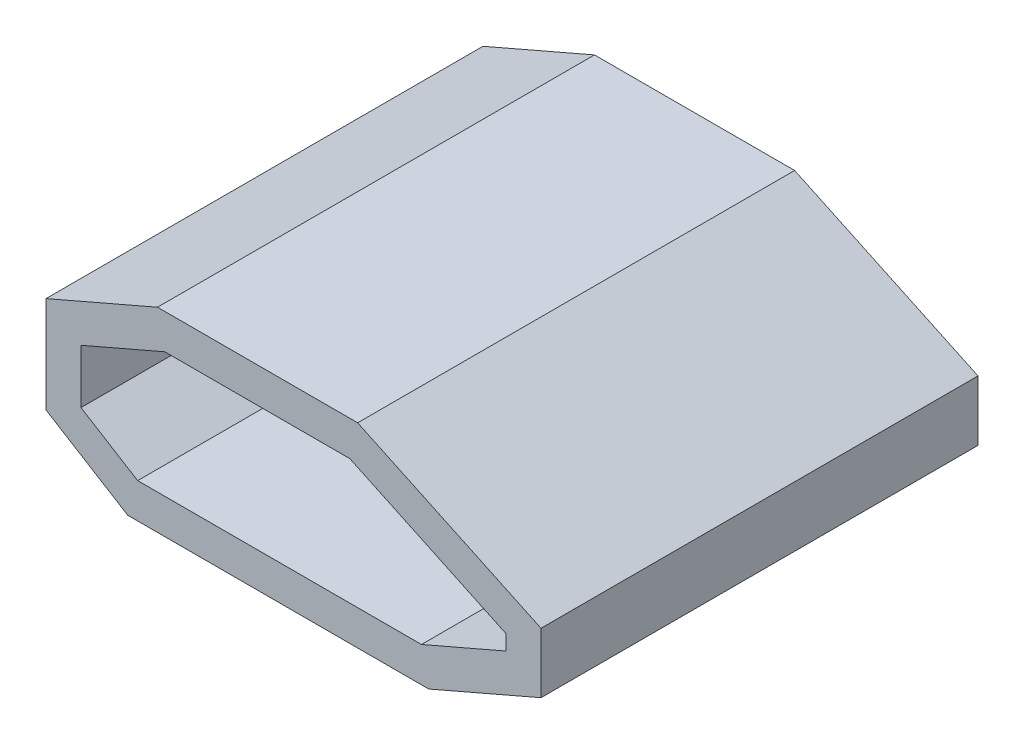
ISO-10303-21;
HEADER;
FILE_DESCRIPTION(('STEP AP214'),'2;1');
FILE_NAME('part.step','',(''),(''),'','','');
FILE_SCHEMA(('AUTOMOTIVE_DESIGN { 1 0 10303 214 1 1 1 1 }'));
ENDSEC;
DATA;
#1=APPLICATION_CONTEXT('core data for automotive mechanical design processes');
#2=APPLICATION_PROTOCOL_DEFINITION('international standard','automotive_design',2000,#1);
#3=PRODUCT_CONTEXT('',#1,'mechanical');
#4=PRODUCT('Part','Part','',(#3));
#5=PRODUCT_RELATED_PRODUCT_CATEGORY('part','',(#4));
#6=PRODUCT_DEFINITION_FORMATION('','',#4);
#7=PRODUCT_DEFINITION_CONTEXT('part definition',#1,'design');
#8=PRODUCT_DEFINITION('design','',#6,#7);
#9=PRODUCT_DEFINITION_SHAPE('','',#8);
#10=(LENGTH_UNIT() NAMED_UNIT(*) SI_UNIT(.MILLI.,.METRE.));
#11=(NAMED_UNIT(*) PLANE_ANGLE_UNIT() SI_UNIT($,.RADIAN.));
#12=(NAMED_UNIT(*) SI_UNIT($,.STERADIAN.) SOLID_ANGLE_UNIT());
#13=UNCERTAINTY_MEASURE_WITH_UNIT(LENGTH_MEASURE(1.E-05),#10,'distance_accuracy_value','');
#14=(GEOMETRIC_REPRESENTATION_CONTEXT(3) GLOBAL_UNCERTAINTY_ASSIGNED_CONTEXT((#13)) GLOBAL_UNIT_ASSIGNED_CONTEXT((#10,
#11,#12)) REPRESENTATION_CONTEXT('',''));
#15=CARTESIAN_POINT('',(0.,0.,0.));
#16=DIRECTION('',(0.,0.,1.));
#17=DIRECTION('',(1.,0.,0.));
#18=AXIS2_PLACEMENT_3D('',#15,#16,#17);
#19=CARTESIAN_POINT('',(0.,0.,125.));
#20=DIRECTION('',(0.,0.,1.));
#21=DIRECTION('',(1.,0.,0.));
#22=AXIS2_PLACEMENT_3D('',#19,#20,#21);
#23=PLANE('',#22);
#24=DIRECTION('',(0.851606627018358,-0.524181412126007,0.));
#25=VECTOR('',#24,1.);
#26=CARTESIAN_POINT('',(-5.24181412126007,-8.51606627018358,125.));
#27=LINE('',#26,#25);
#28=CARTESIAN_POINT('',(-10.,-5.5873048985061,125.));
#29=VERTEX_POINT('',#28);
#30=CARTESIAN_POINT('',(36.7704872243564,-34.3755027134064,125.));
#31=VERTEX_POINT('',#30);
#32=EDGE_CURVE('E259',#29,#31,#27,.T.);
#33=ORIENTED_EDGE('',*,*,#32,.T.);
#34=DIRECTION('',(1.,0.,0.));
#35=VECTOR('',#34,1.);
#36=CARTESIAN_POINT('',(0.,-34.3755027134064,125.));
#37=LINE('',#36,#35);
#38=CARTESIAN_POINT('',(208.93833779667,-34.3755027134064,125.));
#39=VERTEX_POINT('',#38);
#40=EDGE_CURVE('E262',#31,#39,#37,.T.);
#41=ORIENTED_EDGE('',*,*,#40,.T.);
#42=DIRECTION('',(0.917700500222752,0.397272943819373,0.));
#43=VECTOR('',#42,1.);
#44=CARTESIAN_POINT('',(45.5083961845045,-105.124395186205,125.));
#45=LINE('',#44,#43);
#46=CARTESIAN_POINT('',(273.1741380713,-6.56779696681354,125.));
#47=VERTEX_POINT('',#46);
#48=EDGE_CURVE('E265',#39,#47,#45,.T.);
#49=ORIENTED_EDGE('',*,*,#48,.T.);
#50=DIRECTION('',(0.,1.,0.));
#51=VECTOR('',#50,1.);
#52=CARTESIAN_POINT('',(273.1741380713,0.,125.));
#53=LINE('',#52,#51);
#54=CARTESIAN_POINT('',(273.1741380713,27.8623389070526,125.));
#55=VERTEX_POINT('',#54);
#56=EDGE_CURVE('E267',#47,#55,#53,.T.);
#57=ORIENTED_EDGE('',*,*,#56,.T.);
#58=DIRECTION('',(-0.904873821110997,0.425679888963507,0.));
#59=VECTOR('',#58,1.);
#60=CARTESIAN_POINT('',(60.2322730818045,128.036603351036,125.));
#61=LINE('',#60,#59);
#62=CARTESIAN_POINT('',(168.285037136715,77.2053299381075,125.));
#63=VERTEX_POINT('',#62);
#64=EDGE_CURVE('E269',#55,#63,#61,.T.);
#65=ORIENTED_EDGE('',*,*,#64,.T.);
#66=DIRECTION('',(-1.,0.,0.));
#67=VECTOR('',#66,1.);
#68=CARTESIAN_POINT('',(0.,77.2053299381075,125.));
#69=LINE('',#68,#67);
#70=CARTESIAN_POINT('',(53.7716667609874,77.2053299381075,125.));
#71=VERTEX_POINT('',#70);
#72=EDGE_CURVE('E271',#63,#71,#69,.T.);
#73=ORIENTED_EDGE('',*,*,#72,.T.);
#74=DIRECTION('',(-0.917700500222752,-0.397272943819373,0.));
#75=VECTOR('',#74,1.);
#76=CARTESIAN_POINT('',(-19.6607764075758,45.4163935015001,125.));
#77=LINE('',#76,#75);
#78=CARTESIAN_POINT('',(-10.,49.5985477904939,125.));
#79=VERTEX_POINT('',#78);
#80=EDGE_CURVE('E273',#71,#79,#77,.T.);
#81=ORIENTED_EDGE('',*,*,#80,.T.);
#82=DIRECTION('',(0.,-1.,0.));
#83=VECTOR('',#82,1.);
#84=CARTESIAN_POINT('',(-10.,0.,125.));
#85=LINE('',#84,#83);
#86=EDGE_CURVE('E275',#79,#29,#85,.T.);
#87=ORIENTED_EDGE('',*,*,#86,.T.);
#88=EDGE_LOOP('',(#33,#41,#49,#57,#65,#73,#81,#87));
#89=FACE_BOUND('',#88,.T.);
#90=DIRECTION('',(1.,0.,0.));
#91=VECTOR('',#90,1.);
#92=CARTESIAN_POINT('',(0.,-14.3755027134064,125.));
#93=LINE('',#92,#91);
#94=CARTESIAN_POINT('',(42.432396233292,-14.3755027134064,125.));
#95=VERTEX_POINT('',#94);
#96=CARTESIAN_POINT('',(204.795115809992,-14.3755027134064,125.));
#97=VERTEX_POINT('',#96);
#98=EDGE_CURVE('E202',#95,#97,#93,.T.);
#99=ORIENTED_EDGE('',*,*,#98,.F.);
#100=DIRECTION('',(0.851606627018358,-0.524181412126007,0.));
#101=VECTOR('',#100,1.);
#102=CARTESIAN_POINT('',(5.24181412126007,8.51606627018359,125.));
#103=LINE('',#102,#101);
#104=CARTESIAN_POINT('',(10.,5.58730489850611,125.));
#105=VERTEX_POINT('',#104);
#106=EDGE_CURVE('E194',#105,#95,#103,.T.);
#107=ORIENTED_EDGE('',*,*,#106,.F.);
#108=DIRECTION('',(0.,-1.,0.));
#109=VECTOR('',#108,1.);
#110=CARTESIAN_POINT('',(10.,0.,125.));
#111=LINE('',#110,#109);
#112=CARTESIAN_POINT('',(10.,36.4629538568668,125.));
#113=VERTEX_POINT('',#112);
#114=EDGE_CURVE('E227',#113,#105,#111,.T.);
#115=ORIENTED_EDGE('',*,*,#114,.F.);
#116=DIRECTION('',(-0.917700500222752,-0.397272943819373,0.));
#117=VECTOR('',#116,1.);
#118=CARTESIAN_POINT('',(-11.7153175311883,27.062383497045,125.));
#119=LINE('',#118,#117);
#120=CARTESIAN_POINT('',(57.914888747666,57.2053299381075,125.));
#121=VERTEX_POINT('',#120);
#122=EDGE_CURVE('E225',#121,#113,#119,.T.);
#123=ORIENTED_EDGE('',*,*,#122,.F.);
#124=DIRECTION('',(-1.,0.,0.));
#125=VECTOR('',#124,1.);
#126=CARTESIAN_POINT('',(0.,57.2053299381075,125.));
#127=LINE('',#126,#125);
#128=CARTESIAN_POINT('',(163.81566090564,57.2053299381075,125.));
#129=VERTEX_POINT('',#128);
#130=EDGE_CURVE('E223',#129,#121,#127,.T.);
#131=ORIENTED_EDGE('',*,*,#130,.F.);
#132=DIRECTION('',(-0.904873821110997,0.425679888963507,0.));
#133=VECTOR('',#132,1.);
#134=CARTESIAN_POINT('',(51.7186753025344,109.939126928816,125.));
#135=LINE('',#134,#133);
#136=CARTESIAN_POINT('',(253.1741380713,15.1684119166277,125.));
#137=VERTEX_POINT('',#136);
#138=EDGE_CURVE('E221',#137,#129,#135,.T.);
#139=ORIENTED_EDGE('',*,*,#138,.F.);
#140=DIRECTION('',(0.,1.,0.));
#141=VECTOR('',#140,1.);
#142=CARTESIAN_POINT('',(253.1741380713,0.,125.));
#143=LINE('',#142,#141);
#144=CARTESIAN_POINT('',(253.1741380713,6.56779696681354,125.));
#145=VERTEX_POINT('',#144);
#146=EDGE_CURVE('E217',#145,#137,#143,.T.);
#147=ORIENTED_EDGE('',*,*,#146,.F.);
#148=DIRECTION('',(0.917700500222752,0.397272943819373,0.));
#149=VECTOR('',#148,1.);
#150=CARTESIAN_POINT('',(37.562937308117,-86.7703851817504,125.));
#151=LINE('',#150,#149);
#152=EDGE_CURVE('E215',#97,#145,#151,.T.);
#153=ORIENTED_EDGE('',*,*,#152,.F.);
#154=EDGE_LOOP('',(#99,#107,#115,#123,#131,#139,#147,#153));
#155=FACE_BOUND('',#154,.T.);
#156=ADVANCED_FACE('F81',(#89,#155),#23,.T.);
#157=CARTESIAN_POINT('',(0.,0.,-125.));
#158=DIRECTION('',(0.,0.,1.));
#159=DIRECTION('',(1.,0.,0.));
#160=AXIS2_PLACEMENT_3D('',#157,#158,#159);
#161=PLANE('',#160);
#162=DIRECTION('',(0.851606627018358,-0.524181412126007,0.));
#163=VECTOR('',#162,1.);
#164=CARTESIAN_POINT('',(-5.24181412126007,-8.51606627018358,-125.));
#165=LINE('',#164,#163);
#166=CARTESIAN_POINT('',(-10.,-5.5873048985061,-125.));
#167=VERTEX_POINT('',#166);
#168=CARTESIAN_POINT('',(36.7704872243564,-34.3755027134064,-125.));
#169=VERTEX_POINT('',#168);
#170=EDGE_CURVE('E210',#167,#169,#165,.T.);
#171=ORIENTED_EDGE('',*,*,#170,.F.);
#172=DIRECTION('',(0.,-1.,0.));
#173=VECTOR('',#172,1.);
#174=CARTESIAN_POINT('',(-10.,0.,-125.));
#175=LINE('',#174,#173);
#176=CARTESIAN_POINT('',(-10.,49.5985477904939,-125.));
#177=VERTEX_POINT('',#176);
#178=EDGE_CURVE('E263',#177,#167,#175,.T.);
#179=ORIENTED_EDGE('',*,*,#178,.F.);
#180=DIRECTION('',(-0.917700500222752,-0.397272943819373,0.));
#181=VECTOR('',#180,1.);
#182=CARTESIAN_POINT('',(-19.6607764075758,45.4163935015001,-125.));
#183=LINE('',#182,#181);
#184=CARTESIAN_POINT('',(53.7716667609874,77.2053299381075,-125.));
#185=VERTEX_POINT('',#184);
#186=EDGE_CURVE('E290',#185,#177,#183,.T.);
#187=ORIENTED_EDGE('',*,*,#186,.F.);
#188=DIRECTION('',(-1.,0.,0.));
#189=VECTOR('',#188,1.);
#190=CARTESIAN_POINT('',(0.,77.2053299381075,-125.));
#191=LINE('',#190,#189);
#192=CARTESIAN_POINT('',(168.285037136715,77.2053299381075,-125.));
#193=VERTEX_POINT('',#192);
#194=EDGE_CURVE('E288',#193,#185,#191,.T.);
#195=ORIENTED_EDGE('',*,*,#194,.F.);
#196=DIRECTION('',(-0.904873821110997,0.425679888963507,0.));
#197=VECTOR('',#196,1.);
#198=CARTESIAN_POINT('',(60.2322730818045,128.036603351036,-125.));
#199=LINE('',#198,#197);
#200=CARTESIAN_POINT('',(273.1741380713,27.8623389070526,-125.));
#201=VERTEX_POINT('',#200);
#202=EDGE_CURVE('E286',#201,#193,#199,.T.);
#203=ORIENTED_EDGE('',*,*,#202,.F.);
#204=DIRECTION('',(0.,1.,0.));
#205=VECTOR('',#204,1.);
#206=CARTESIAN_POINT('',(273.1741380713,0.,-125.));
#207=LINE('',#206,#205);
#208=CARTESIAN_POINT('',(273.1741380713,-6.56779696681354,-125.));
#209=VERTEX_POINT('',#208);
#210=EDGE_CURVE('E284',#209,#201,#207,.T.);
#211=ORIENTED_EDGE('',*,*,#210,.F.);
#212=DIRECTION('',(0.917700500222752,0.397272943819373,0.));
#213=VECTOR('',#212,1.);
#214=CARTESIAN_POINT('',(45.5083961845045,-105.124395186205,-125.));
#215=LINE('',#214,#213);
#216=CARTESIAN_POINT('',(208.93833779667,-34.3755027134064,-125.));
#217=VERTEX_POINT('',#216);
#218=EDGE_CURVE('E282',#217,#209,#215,.T.);
#219=ORIENTED_EDGE('',*,*,#218,.F.);
#220=DIRECTION('',(1.,0.,0.));
#221=VECTOR('',#220,1.);
#222=CARTESIAN_POINT('',(0.,-34.3755027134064,-125.));
#223=LINE('',#222,#221);
#224=EDGE_CURVE('E280',#169,#217,#223,.T.);
#225=ORIENTED_EDGE('',*,*,#224,.F.);
#226=EDGE_LOOP('',(#171,#179,#187,#195,#203,#211,#219,#225));
#227=FACE_BOUND('',#226,.T.);
#228=DIRECTION('',(0.851606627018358,-0.524181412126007,0.));
#229=VECTOR('',#228,1.);
#230=CARTESIAN_POINT('',(5.24181412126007,8.51606627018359,-125.));
#231=LINE('',#230,#229);
#232=CARTESIAN_POINT('',(10.,5.58730489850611,-125.));
#233=VERTEX_POINT('',#232);
#234=CARTESIAN_POINT('',(42.432396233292,-14.3755027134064,-125.));
#235=VERTEX_POINT('',#234);
#236=EDGE_CURVE('E104',#233,#235,#231,.T.);
#237=ORIENTED_EDGE('',*,*,#236,.T.);
#238=DIRECTION('',(1.,0.,0.));
#239=VECTOR('',#238,1.);
#240=CARTESIAN_POINT('',(0.,-14.3755027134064,-125.));
#241=LINE('',#240,#239);
#242=CARTESIAN_POINT('',(204.795115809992,-14.3755027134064,-125.));
#243=VERTEX_POINT('',#242);
#244=EDGE_CURVE('E209',#235,#243,#241,.T.);
#245=ORIENTED_EDGE('',*,*,#244,.T.);
#246=DIRECTION('',(0.917700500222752,0.397272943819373,0.));
#247=VECTOR('',#246,1.);
#248=CARTESIAN_POINT('',(37.562937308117,-86.7703851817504,-125.));
#249=LINE('',#248,#247);
#250=CARTESIAN_POINT('',(253.1741380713,6.56779696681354,-125.));
#251=VERTEX_POINT('',#250);
#252=EDGE_CURVE('E231',#243,#251,#249,.T.);
#253=ORIENTED_EDGE('',*,*,#252,.T.);
#254=DIRECTION('',(0.,1.,0.));
#255=VECTOR('',#254,1.);
#256=CARTESIAN_POINT('',(253.1741380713,0.,-125.));
#257=LINE('',#256,#255);
#258=CARTESIAN_POINT('',(253.1741380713,15.1684119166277,-125.));
#259=VERTEX_POINT('',#258);
#260=EDGE_CURVE('E234',#251,#259,#257,.T.);
#261=ORIENTED_EDGE('',*,*,#260,.T.);
#262=DIRECTION('',(-0.904873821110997,0.425679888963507,0.));
#263=VECTOR('',#262,1.);
#264=CARTESIAN_POINT('',(51.7186753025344,109.939126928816,-125.));
#265=LINE('',#264,#263);
#266=CARTESIAN_POINT('',(163.81566090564,57.2053299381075,-125.));
#267=VERTEX_POINT('',#266);
#268=EDGE_CURVE('E237',#259,#267,#265,.T.);
#269=ORIENTED_EDGE('',*,*,#268,.T.);
#270=DIRECTION('',(-1.,0.,0.));
#271=VECTOR('',#270,1.);
#272=CARTESIAN_POINT('',(0.,57.2053299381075,-125.));
#273=LINE('',#272,#271);
#274=CARTESIAN_POINT('',(57.914888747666,57.2053299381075,-125.));
#275=VERTEX_POINT('',#274);
#276=EDGE_CURVE('E240',#267,#275,#273,.T.);
#277=ORIENTED_EDGE('',*,*,#276,.T.);
#278=DIRECTION('',(-0.917700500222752,-0.397272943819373,0.));
#279=VECTOR('',#278,1.);
#280=CARTESIAN_POINT('',(-11.7153175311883,27.062383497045,-125.));
#281=LINE('',#280,#279);
#282=CARTESIAN_POINT('',(10.,36.4629538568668,-125.));
#283=VERTEX_POINT('',#282);
#284=EDGE_CURVE('E243',#275,#283,#281,.T.);
#285=ORIENTED_EDGE('',*,*,#284,.T.);
#286=DIRECTION('',(0.,-1.,0.));
#287=VECTOR('',#286,1.);
#288=CARTESIAN_POINT('',(10.,0.,-125.));
#289=LINE('',#288,#287);
#290=EDGE_CURVE('E203',#283,#233,#289,.T.);
#291=ORIENTED_EDGE('',*,*,#290,.T.);
#292=EDGE_LOOP('',(#237,#245,#253,#261,#269,#277,#285,#291));
#293=FACE_BOUND('',#292,.T.);
#294=ADVANCED_FACE('F320',(#227,#293),#161,.F.);
#295=CARTESIAN_POINT('',(-5.24181412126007,-8.51606627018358,125.));
#296=DIRECTION('',(0.524181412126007,0.851606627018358,0.));
#297=DIRECTION('',(-0.851606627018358,0.524181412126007,0.));
#298=AXIS2_PLACEMENT_3D('',#295,#296,#297);
#299=PLANE('',#298);
#300=ORIENTED_EDGE('',*,*,#170,.T.);
#301=DIRECTION('',(0.,0.,-1.));
#302=VECTOR('',#301,1.);
#303=CARTESIAN_POINT('',(36.7704872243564,-34.3755027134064,125.));
#304=LINE('',#303,#302);
#305=EDGE_CURVE('E12',#31,#169,#304,.T.);
#306=ORIENTED_EDGE('',*,*,#305,.F.);
#307=ORIENTED_EDGE('',*,*,#32,.F.);
#308=DIRECTION('',(0.,0.,-1.));
#309=VECTOR('',#308,1.);
#310=CARTESIAN_POINT('',(-10.,-5.5873048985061,125.));
#311=LINE('',#310,#309);
#312=EDGE_CURVE('E277',#29,#167,#311,.T.);
#313=ORIENTED_EDGE('',*,*,#312,.T.);
#314=EDGE_LOOP('',(#300,#306,#307,#313));
#315=FACE_BOUND('',#314,.T.);
#316=ADVANCED_FACE('F83',(#315),#299,.F.);
#317=CARTESIAN_POINT('',(0.,-34.3755027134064,125.));
#318=DIRECTION('',(0.,1.,0.));
#319=DIRECTION('',(0.,0.,1.));
#320=AXIS2_PLACEMENT_3D('',#317,#318,#319);
#321=PLANE('',#320);
#322=ORIENTED_EDGE('',*,*,#224,.T.);
#323=DIRECTION('',(0.,0.,-1.));
#324=VECTOR('',#323,1.);
#325=CARTESIAN_POINT('',(208.93833779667,-34.3755027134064,125.));
#326=LINE('',#325,#324);
#327=EDGE_CURVE('E89',#39,#217,#326,.T.);
#328=ORIENTED_EDGE('',*,*,#327,.F.);
#329=ORIENTED_EDGE('',*,*,#40,.F.);
#330=ORIENTED_EDGE('',*,*,#305,.T.);
#331=EDGE_LOOP('',(#322,#328,#329,#330));
#332=FACE_BOUND('',#331,.T.);
#333=ADVANCED_FACE('F337',(#332),#321,.F.);
#334=CARTESIAN_POINT('',(45.5083961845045,-105.124395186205,125.));
#335=DIRECTION('',(-0.397272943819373,0.917700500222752,0.));
#336=DIRECTION('',(-0.917700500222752,-0.397272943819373,0.));
#337=AXIS2_PLACEMENT_3D('',#334,#335,#336);
#338=PLANE('',#337);
#339=ORIENTED_EDGE('',*,*,#218,.T.);
#340=DIRECTION('',(0.,0.,-1.));
#341=VECTOR('',#340,1.);
#342=CARTESIAN_POINT('',(273.1741380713,-6.56779696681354,125.));
#343=LINE('',#342,#341);
#344=EDGE_CURVE('E307',#47,#209,#343,.T.);
#345=ORIENTED_EDGE('',*,*,#344,.F.);
#346=ORIENTED_EDGE('',*,*,#48,.F.);
#347=ORIENTED_EDGE('',*,*,#327,.T.);
#348=EDGE_LOOP('',(#339,#345,#346,#347));
#349=FACE_BOUND('',#348,.T.);
#350=ADVANCED_FACE('F314',(#349),#338,.F.);
#351=CARTESIAN_POINT('',(273.1741380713,0.,125.));
#352=DIRECTION('',(-1.,0.,0.));
#353=DIRECTION('',(0.,0.,1.));
#354=AXIS2_PLACEMENT_3D('',#351,#352,#353);
#355=PLANE('',#354);
#356=ORIENTED_EDGE('',*,*,#210,.T.);
#357=DIRECTION('',(0.,0.,-1.));
#358=VECTOR('',#357,1.);
#359=CARTESIAN_POINT('',(273.1741380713,27.8623389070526,125.));
#360=LINE('',#359,#358);
#361=EDGE_CURVE('E304',#55,#201,#360,.T.);
#362=ORIENTED_EDGE('',*,*,#361,.F.);
#363=ORIENTED_EDGE('',*,*,#56,.F.);
#364=ORIENTED_EDGE('',*,*,#344,.T.);
#365=EDGE_LOOP('',(#356,#362,#363,#364));
#366=FACE_BOUND('',#365,.T.);
#367=ADVANCED_FACE('F326',(#366),#355,.F.);
#368=CARTESIAN_POINT('',(60.2322730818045,128.036603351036,125.));
#369=DIRECTION('',(-0.425679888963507,-0.904873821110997,0.));
#370=DIRECTION('',(0.904873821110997,-0.425679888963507,0.));
#371=AXIS2_PLACEMENT_3D('',#368,#369,#370);
#372=PLANE('',#371);
#373=ORIENTED_EDGE('',*,*,#202,.T.);
#374=DIRECTION('',(0.,0.,-1.));
#375=VECTOR('',#374,1.);
#376=CARTESIAN_POINT('',(168.285037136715,77.2053299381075,125.));
#377=LINE('',#376,#375);
#378=EDGE_CURVE('E301',#63,#193,#377,.T.);
#379=ORIENTED_EDGE('',*,*,#378,.F.);
#380=ORIENTED_EDGE('',*,*,#64,.F.);
#381=ORIENTED_EDGE('',*,*,#361,.T.);
#382=EDGE_LOOP('',(#373,#379,#380,#381));
#383=FACE_BOUND('',#382,.T.);
#384=ADVANCED_FACE('F330',(#383),#372,.F.);
#385=CARTESIAN_POINT('',(0.,77.2053299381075,125.));
#386=DIRECTION('',(0.,-1.,0.));
#387=DIRECTION('',(0.,0.,-1.));
#388=AXIS2_PLACEMENT_3D('',#385,#386,#387);
#389=PLANE('',#388);
#390=ORIENTED_EDGE('',*,*,#194,.T.);
#391=DIRECTION('',(0.,0.,-1.));
#392=VECTOR('',#391,1.);
#393=CARTESIAN_POINT('',(53.7716667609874,77.2053299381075,125.));
#394=LINE('',#393,#392);
#395=EDGE_CURVE('E298',#71,#185,#394,.T.);
#396=ORIENTED_EDGE('',*,*,#395,.F.);
#397=ORIENTED_EDGE('',*,*,#72,.F.);
#398=ORIENTED_EDGE('',*,*,#378,.T.);
#399=EDGE_LOOP('',(#390,#396,#397,#398));
#400=FACE_BOUND('',#399,.T.);
#401=ADVANCED_FACE('F350',(#400),#389,.F.);
#402=CARTESIAN_POINT('',(-19.6607764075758,45.4163935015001,125.));
#403=DIRECTION('',(0.397272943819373,-0.917700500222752,0.));
#404=DIRECTION('',(0.917700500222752,0.397272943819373,0.));
#405=AXIS2_PLACEMENT_3D('',#402,#403,#404);
#406=PLANE('',#405);
#407=ORIENTED_EDGE('',*,*,#186,.T.);
#408=DIRECTION('',(0.,0.,-1.));
#409=VECTOR('',#408,1.);
#410=CARTESIAN_POINT('',(-10.,49.5985477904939,125.));
#411=LINE('',#410,#409);
#412=EDGE_CURVE('E295',#79,#177,#411,.T.);
#413=ORIENTED_EDGE('',*,*,#412,.F.);
#414=ORIENTED_EDGE('',*,*,#80,.F.);
#415=ORIENTED_EDGE('',*,*,#395,.T.);
#416=EDGE_LOOP('',(#407,#413,#414,#415));
#417=FACE_BOUND('',#416,.T.);
#418=ADVANCED_FACE('F348',(#417),#406,.F.);
#419=CARTESIAN_POINT('',(-10.,0.,125.));
#420=DIRECTION('',(1.,0.,0.));
#421=DIRECTION('',(0.,0.,-1.));
#422=AXIS2_PLACEMENT_3D('',#419,#420,#421);
#423=PLANE('',#422);
#424=ORIENTED_EDGE('',*,*,#178,.T.);
#425=ORIENTED_EDGE('',*,*,#312,.F.);
#426=ORIENTED_EDGE('',*,*,#86,.F.);
#427=ORIENTED_EDGE('',*,*,#412,.T.);
#428=EDGE_LOOP('',(#424,#425,#426,#427));
#429=FACE_BOUND('',#428,.T.);
#430=ADVANCED_FACE('F343',(#429),#423,.F.);
#431=CARTESIAN_POINT('',(5.24181412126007,8.51606627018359,125.));
#432=DIRECTION('',(0.524181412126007,0.851606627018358,0.));
#433=DIRECTION('',(-0.851606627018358,0.524181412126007,0.));
#434=AXIS2_PLACEMENT_3D('',#431,#432,#433);
#435=PLANE('',#434);
#436=ORIENTED_EDGE('',*,*,#236,.F.);
#437=DIRECTION('',(0.,0.,-1.));
#438=VECTOR('',#437,1.);
#439=CARTESIAN_POINT('',(10.,5.58730489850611,125.));
#440=LINE('',#439,#438);
#441=EDGE_CURVE('E198',#105,#233,#440,.T.);
#442=ORIENTED_EDGE('',*,*,#441,.F.);
#443=ORIENTED_EDGE('',*,*,#106,.T.);
#444=DIRECTION('',(0.,0.,-1.));
#445=VECTOR('',#444,1.);
#446=CARTESIAN_POINT('',(42.432396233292,-14.3755027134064,125.));
#447=LINE('',#446,#445);
#448=EDGE_CURVE('E197',#95,#235,#447,.T.);
#449=ORIENTED_EDGE('',*,*,#448,.T.);
#450=EDGE_LOOP('',(#436,#442,#443,#449));
#451=FACE_BOUND('',#450,.T.);
#452=ADVANCED_FACE('F196',(#451),#435,.T.);
#453=CARTESIAN_POINT('',(0.,-14.3755027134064,125.));
#454=DIRECTION('',(0.,1.,0.));
#455=DIRECTION('',(0.,0.,1.));
#456=AXIS2_PLACEMENT_3D('',#453,#454,#455);
#457=PLANE('',#456);
#458=ORIENTED_EDGE('',*,*,#244,.F.);
#459=ORIENTED_EDGE('',*,*,#448,.F.);
#460=ORIENTED_EDGE('',*,*,#98,.T.);
#461=DIRECTION('',(0.,0.,-1.));
#462=VECTOR('',#461,1.);
#463=CARTESIAN_POINT('',(204.795115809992,-14.3755027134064,125.));
#464=LINE('',#463,#462);
#465=EDGE_CURVE('E211',#97,#243,#464,.T.);
#466=ORIENTED_EDGE('',*,*,#465,.T.);
#467=EDGE_LOOP('',(#458,#459,#460,#466));
#468=FACE_BOUND('',#467,.T.);
#469=ADVANCED_FACE('F206',(#468),#457,.T.);
#470=CARTESIAN_POINT('',(37.562937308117,-86.7703851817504,125.));
#471=DIRECTION('',(-0.397272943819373,0.917700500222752,0.));
#472=DIRECTION('',(-0.917700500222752,-0.397272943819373,0.));
#473=AXIS2_PLACEMENT_3D('',#470,#471,#472);
#474=PLANE('',#473);
#475=ORIENTED_EDGE('',*,*,#252,.F.);
#476=ORIENTED_EDGE('',*,*,#465,.F.);
#477=ORIENTED_EDGE('',*,*,#152,.T.);
#478=DIRECTION('',(0.,0.,-1.));
#479=VECTOR('',#478,1.);
#480=CARTESIAN_POINT('',(253.1741380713,6.56779696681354,125.));
#481=LINE('',#480,#479);
#482=EDGE_CURVE('E256',#145,#251,#481,.T.);
#483=ORIENTED_EDGE('',*,*,#482,.T.);
#484=EDGE_LOOP('',(#475,#476,#477,#483));
#485=FACE_BOUND('',#484,.T.);
#486=ADVANCED_FACE('F375',(#485),#474,.T.);
#487=CARTESIAN_POINT('',(253.1741380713,0.,125.));
#488=DIRECTION('',(-1.,0.,0.));
#489=DIRECTION('',(0.,0.,1.));
#490=AXIS2_PLACEMENT_3D('',#487,#488,#489);
#491=PLANE('',#490);
#492=ORIENTED_EDGE('',*,*,#260,.F.);
#493=ORIENTED_EDGE('',*,*,#482,.F.);
#494=ORIENTED_EDGE('',*,*,#146,.T.);
#495=DIRECTION('',(0.,0.,-1.));
#496=VECTOR('',#495,1.);
#497=CARTESIAN_POINT('',(253.1741380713,15.1684119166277,125.));
#498=LINE('',#497,#496);
#499=EDGE_CURVE('E254',#137,#259,#498,.T.);
#500=ORIENTED_EDGE('',*,*,#499,.T.);
#501=EDGE_LOOP('',(#492,#493,#494,#500));
#502=FACE_BOUND('',#501,.T.);
#503=ADVANCED_FACE('F379',(#502),#491,.T.);
#504=CARTESIAN_POINT('',(51.7186753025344,109.939126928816,125.));
#505=DIRECTION('',(-0.425679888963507,-0.904873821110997,0.));
#506=DIRECTION('',(0.904873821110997,-0.425679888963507,0.));
#507=AXIS2_PLACEMENT_3D('',#504,#505,#506);
#508=PLANE('',#507);
#509=ORIENTED_EDGE('',*,*,#268,.F.);
#510=ORIENTED_EDGE('',*,*,#499,.F.);
#511=ORIENTED_EDGE('',*,*,#138,.T.);
#512=DIRECTION('',(0.,0.,-1.));
#513=VECTOR('',#512,1.);
#514=CARTESIAN_POINT('',(163.81566090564,57.2053299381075,125.));
#515=LINE('',#514,#513);
#516=EDGE_CURVE('E252',#129,#267,#515,.T.);
#517=ORIENTED_EDGE('',*,*,#516,.T.);
#518=EDGE_LOOP('',(#509,#510,#511,#517));
#519=FACE_BOUND('',#518,.T.);
#520=ADVANCED_FACE('F385',(#519),#508,.T.);
#521=CARTESIAN_POINT('',(0.,57.2053299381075,125.));
#522=DIRECTION('',(0.,-1.,0.));
#523=DIRECTION('',(0.,0.,-1.));
#524=AXIS2_PLACEMENT_3D('',#521,#522,#523);
#525=PLANE('',#524);
#526=ORIENTED_EDGE('',*,*,#276,.F.);
#527=ORIENTED_EDGE('',*,*,#516,.F.);
#528=ORIENTED_EDGE('',*,*,#130,.T.);
#529=DIRECTION('',(0.,0.,-1.));
#530=VECTOR('',#529,1.);
#531=CARTESIAN_POINT('',(57.914888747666,57.2053299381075,125.));
#532=LINE('',#531,#530);
#533=EDGE_CURVE('E250',#121,#275,#532,.T.);
#534=ORIENTED_EDGE('',*,*,#533,.T.);
#535=EDGE_LOOP('',(#526,#527,#528,#534));
#536=FACE_BOUND('',#535,.T.);
#537=ADVANCED_FACE('F389',(#536),#525,.T.);
#538=CARTESIAN_POINT('',(-11.7153175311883,27.062383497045,125.));
#539=DIRECTION('',(0.397272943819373,-0.917700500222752,0.));
#540=DIRECTION('',(0.917700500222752,0.397272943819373,0.));
#541=AXIS2_PLACEMENT_3D('',#538,#539,#540);
#542=PLANE('',#541);
#543=ORIENTED_EDGE('',*,*,#284,.F.);
#544=ORIENTED_EDGE('',*,*,#533,.F.);
#545=ORIENTED_EDGE('',*,*,#122,.T.);
#546=DIRECTION('',(0.,0.,-1.));
#547=VECTOR('',#546,1.);
#548=CARTESIAN_POINT('',(10.,36.4629538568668,125.));
#549=LINE('',#548,#547);
#550=EDGE_CURVE('E96',#113,#283,#549,.T.);
#551=ORIENTED_EDGE('',*,*,#550,.T.);
#552=EDGE_LOOP('',(#543,#544,#545,#551));
#553=FACE_BOUND('',#552,.T.);
#554=ADVANCED_FACE('F393',(#553),#542,.T.);
#555=CARTESIAN_POINT('',(10.,0.,125.));
#556=DIRECTION('',(1.,0.,0.));
#557=DIRECTION('',(0.,0.,-1.));
#558=AXIS2_PLACEMENT_3D('',#555,#556,#557);
#559=PLANE('',#558);
#560=ORIENTED_EDGE('',*,*,#290,.F.);
#561=ORIENTED_EDGE('',*,*,#550,.F.);
#562=ORIENTED_EDGE('',*,*,#114,.T.);
#563=ORIENTED_EDGE('',*,*,#441,.T.);
#564=EDGE_LOOP('',(#560,#561,#562,#563));
#565=FACE_BOUND('',#564,.T.);
#566=ADVANCED_FACE('F397',(#565),#559,.T.);
#567=CLOSED_SHELL('',(#156,#294,#316,#333,#350,#367,#384,#401,#418,#430,#452,#469,#486,#503,
#520,#537,#554,#566));
#568=MANIFOLD_SOLID_BREP('B2',#567);
#569=ADVANCED_BREP_SHAPE_REPRESENTATION('',(#18,#568),#14);
#570=SHAPE_DEFINITION_REPRESENTATION(#9,#569);
ENDSEC;
END-ISO-10303-21;
